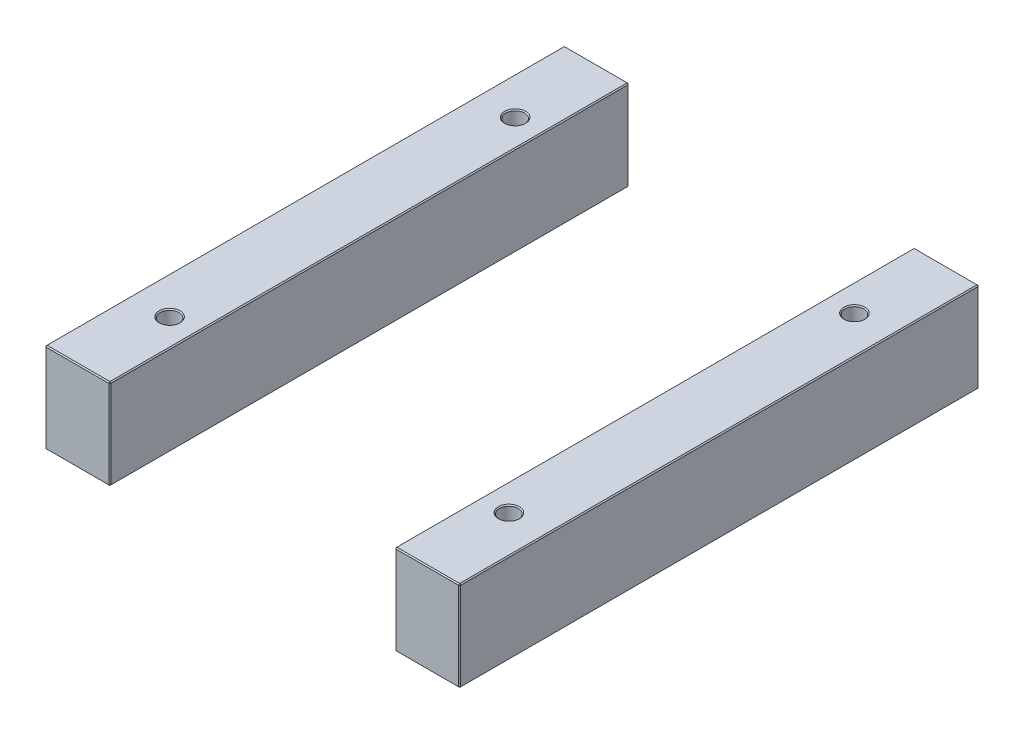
ISO-10303-21;
HEADER;
FILE_DESCRIPTION(('STEP AP214'),'2;1');
FILE_NAME('part.step','',(''),(''),'','','');
FILE_SCHEMA(('AUTOMOTIVE_DESIGN { 1 0 10303 214 1 1 1 1 }'));
ENDSEC;
DATA;
#1=APPLICATION_CONTEXT('core data for automotive mechanical design processes');
#2=APPLICATION_PROTOCOL_DEFINITION('international standard','automotive_design',2000,#1);
#3=PRODUCT_CONTEXT('',#1,'mechanical');
#4=PRODUCT('Part','Part','',(#3));
#5=PRODUCT_RELATED_PRODUCT_CATEGORY('part','',(#4));
#6=PRODUCT_DEFINITION_FORMATION('','',#4);
#7=PRODUCT_DEFINITION_CONTEXT('part definition',#1,'design');
#8=PRODUCT_DEFINITION('design','',#6,#7);
#9=PRODUCT_DEFINITION_SHAPE('','',#8);
#10=(LENGTH_UNIT() NAMED_UNIT(*) SI_UNIT(.MILLI.,.METRE.));
#11=(NAMED_UNIT(*) PLANE_ANGLE_UNIT() SI_UNIT($,.RADIAN.));
#12=(NAMED_UNIT(*) SI_UNIT($,.STERADIAN.) SOLID_ANGLE_UNIT());
#13=UNCERTAINTY_MEASURE_WITH_UNIT(LENGTH_MEASURE(1.E-05),#10,'distance_accuracy_value','');
#14=(GEOMETRIC_REPRESENTATION_CONTEXT(3) GLOBAL_UNCERTAINTY_ASSIGNED_CONTEXT((#13)) GLOBAL_UNIT_ASSIGNED_CONTEXT((#10,
#11,#12)) REPRESENTATION_CONTEXT('',''));
#15=CARTESIAN_POINT('',(0.,0.,0.));
#16=DIRECTION('',(0.,0.,1.));
#17=DIRECTION('',(1.,0.,0.));
#18=AXIS2_PLACEMENT_3D('',#15,#16,#17);
#19=CARTESIAN_POINT('',(-198.,86.,-248.));
#20=DIRECTION('',(0.,0.,1.));
#21=DIRECTION('',(1.,0.,0.));
#22=AXIS2_PLACEMENT_3D('',#19,#20,#21);
#23=PLANE('',#22);
#24=DIRECTION('',(-1.,0.,0.));
#25=VECTOR('',#24,1.);
#26=CARTESIAN_POINT('',(-198.,0.999999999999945,-248.));
#27=LINE('',#26,#25);
#28=CARTESIAN_POINT('',(-137.,0.999999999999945,-248.));
#29=VERTEX_POINT('',#28);
#30=CARTESIAN_POINT('',(-197.,0.999999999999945,-248.));
#31=VERTEX_POINT('',#30);
#32=EDGE_CURVE('P0_E137',#29,#31,#27,.T.);
#33=ORIENTED_EDGE('',*,*,#32,.T.);
#34=DIRECTION('',(0.,1.,0.));
#35=VECTOR('',#34,1.);
#36=CARTESIAN_POINT('',(-197.,86.,-248.));
#37=LINE('',#36,#35);
#38=CARTESIAN_POINT('',(-197.,85.,-248.));
#39=VERTEX_POINT('',#38);
#40=EDGE_CURVE('P0_E235',#31,#39,#37,.T.);
#41=ORIENTED_EDGE('',*,*,#40,.T.);
#42=DIRECTION('',(1.,0.,0.));
#43=VECTOR('',#42,1.);
#44=CARTESIAN_POINT('',(-198.,85.,-248.));
#45=LINE('',#44,#43);
#46=CARTESIAN_POINT('',(-137.,85.,-248.));
#47=VERTEX_POINT('',#46);
#48=EDGE_CURVE('P0_E233',#39,#47,#45,.T.);
#49=ORIENTED_EDGE('',*,*,#48,.T.);
#50=DIRECTION('',(0.,-1.,0.));
#51=VECTOR('',#50,1.);
#52=CARTESIAN_POINT('',(-137.,86.,-248.));
#53=LINE('',#52,#51);
#54=EDGE_CURVE('P0_E230',#47,#29,#53,.T.);
#55=ORIENTED_EDGE('',*,*,#54,.T.);
#56=EDGE_LOOP('',(#33,#41,#49,#55));
#57=FACE_BOUND('',#56,.T.);
#58=ADVANCED_FACE('P0_F16',(#57),#23,.F.);
#59=CARTESIAN_POINT('',(-198.,86.,248.));
#60=DIRECTION('',(1.,0.,0.));
#61=DIRECTION('',(0.,0.,-1.));
#62=AXIS2_PLACEMENT_3D('',#59,#60,#61);
#63=PLANE('',#62);
#64=DIRECTION('',(0.,1.,0.));
#65=VECTOR('',#64,1.);
#66=CARTESIAN_POINT('',(-198.,86.,247.));
#67=LINE('',#66,#65);
#68=CARTESIAN_POINT('',(-198.,0.999999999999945,247.));
#69=VERTEX_POINT('',#68);
#70=CARTESIAN_POINT('',(-198.,85.,247.));
#71=VERTEX_POINT('',#70);
#72=EDGE_CURVE('P0_E217',#69,#71,#67,.T.);
#73=ORIENTED_EDGE('',*,*,#72,.T.);
#74=DIRECTION('',(0.,0.,-1.));
#75=VECTOR('',#74,1.);
#76=CARTESIAN_POINT('',(-198.,85.,248.));
#77=LINE('',#76,#75);
#78=CARTESIAN_POINT('',(-198.,85.,-247.));
#79=VERTEX_POINT('',#78);
#80=EDGE_CURVE('P0_E228',#71,#79,#77,.T.);
#81=ORIENTED_EDGE('',*,*,#80,.T.);
#82=DIRECTION('',(0.,-1.,0.));
#83=VECTOR('',#82,1.);
#84=CARTESIAN_POINT('',(-198.,86.,-247.));
#85=LINE('',#84,#83);
#86=CARTESIAN_POINT('',(-198.,0.999999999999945,-247.));
#87=VERTEX_POINT('',#86);
#88=EDGE_CURVE('P0_E225',#79,#87,#85,.T.);
#89=ORIENTED_EDGE('',*,*,#88,.T.);
#90=DIRECTION('',(0.,0.,1.));
#91=VECTOR('',#90,1.);
#92=CARTESIAN_POINT('',(-198.,0.999999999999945,248.));
#93=LINE('',#92,#91);
#94=EDGE_CURVE('P0_E214',#87,#69,#93,.T.);
#95=ORIENTED_EDGE('',*,*,#94,.T.);
#96=EDGE_LOOP('',(#73,#81,#89,#95));
#97=FACE_BOUND('',#96,.T.);
#98=ADVANCED_FACE('P0_F302',(#97),#63,.F.);
#99=CARTESIAN_POINT('',(-198.,86.,248.));
#100=DIRECTION('',(0.,0.,-1.));
#101=DIRECTION('',(-1.,0.,0.));
#102=AXIS2_PLACEMENT_3D('',#99,#100,#101);
#103=PLANE('',#102);
#104=DIRECTION('',(-1.,0.,0.));
#105=VECTOR('',#104,1.);
#106=CARTESIAN_POINT('',(-198.,85.,248.));
#107=LINE('',#106,#105);
#108=CARTESIAN_POINT('',(-137.,85.,248.));
#109=VERTEX_POINT('',#108);
#110=CARTESIAN_POINT('',(-197.,85.,248.));
#111=VERTEX_POINT('',#110);
#112=EDGE_CURVE('P0_E242',#109,#111,#107,.T.);
#113=ORIENTED_EDGE('',*,*,#112,.T.);
#114=DIRECTION('',(0.,-1.,0.));
#115=VECTOR('',#114,1.);
#116=CARTESIAN_POINT('',(-197.,86.,248.));
#117=LINE('',#116,#115);
#118=CARTESIAN_POINT('',(-197.,0.999999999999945,248.));
#119=VERTEX_POINT('',#118);
#120=EDGE_CURVE('P0_E244',#111,#119,#117,.T.);
#121=ORIENTED_EDGE('',*,*,#120,.T.);
#122=DIRECTION('',(1.,0.,0.));
#123=VECTOR('',#122,1.);
#124=CARTESIAN_POINT('',(-136.,0.999999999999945,248.));
#125=LINE('',#124,#123);
#126=CARTESIAN_POINT('',(-137.,0.999999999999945,248.));
#127=VERTEX_POINT('',#126);
#128=EDGE_CURVE('P0_E240',#119,#127,#125,.T.);
#129=ORIENTED_EDGE('',*,*,#128,.T.);
#130=DIRECTION('',(0.,1.,0.));
#131=VECTOR('',#130,1.);
#132=CARTESIAN_POINT('',(-137.,86.,248.));
#133=LINE('',#132,#131);
#134=EDGE_CURVE('P0_E238',#127,#109,#133,.T.);
#135=ORIENTED_EDGE('',*,*,#134,.T.);
#136=EDGE_LOOP('',(#113,#121,#129,#135));
#137=FACE_BOUND('',#136,.T.);
#138=ADVANCED_FACE('P0_F341',(#137),#103,.F.);
#139=CARTESIAN_POINT('',(-136.,86.,-248.));
#140=DIRECTION('',(-1.,0.,0.));
#141=DIRECTION('',(0.,0.,1.));
#142=AXIS2_PLACEMENT_3D('',#139,#140,#141);
#143=PLANE('',#142);
#144=DIRECTION('',(0.,0.,1.));
#145=VECTOR('',#144,1.);
#146=CARTESIAN_POINT('',(-136.,85.,-248.));
#147=LINE('',#146,#145);
#148=CARTESIAN_POINT('',(-136.,85.,-247.));
#149=VERTEX_POINT('',#148);
#150=CARTESIAN_POINT('',(-136.,85.,247.));
#151=VERTEX_POINT('',#150);
#152=EDGE_CURVE('P0_E31',#149,#151,#147,.T.);
#153=ORIENTED_EDGE('',*,*,#152,.T.);
#154=DIRECTION('',(0.,-1.,0.));
#155=VECTOR('',#154,1.);
#156=CARTESIAN_POINT('',(-136.,86.,247.));
#157=LINE('',#156,#155);
#158=CARTESIAN_POINT('',(-136.,0.999999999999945,247.));
#159=VERTEX_POINT('',#158);
#160=EDGE_CURVE('P0_E190',#151,#159,#157,.T.);
#161=ORIENTED_EDGE('',*,*,#160,.T.);
#162=DIRECTION('',(0.,0.,-1.));
#163=VECTOR('',#162,1.);
#164=CARTESIAN_POINT('',(-136.,0.999999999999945,-248.));
#165=LINE('',#164,#163);
#166=CARTESIAN_POINT('',(-136.,0.999999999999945,-247.));
#167=VERTEX_POINT('',#166);
#168=EDGE_CURVE('P0_E256',#159,#167,#165,.T.);
#169=ORIENTED_EDGE('',*,*,#168,.T.);
#170=DIRECTION('',(0.,1.,0.));
#171=VECTOR('',#170,1.);
#172=CARTESIAN_POINT('',(-136.,86.,-247.));
#173=LINE('',#172,#171);
#174=EDGE_CURVE('P0_E36',#167,#149,#173,.T.);
#175=ORIENTED_EDGE('',*,*,#174,.T.);
#176=EDGE_LOOP('',(#153,#161,#169,#175));
#177=FACE_BOUND('',#176,.T.);
#178=ADVANCED_FACE('P0_F535',(#177),#143,.F.);
#179=CARTESIAN_POINT('',(0.,86.,0.));
#180=DIRECTION('',(0.,-1.,0.));
#181=DIRECTION('',(0.,0.,-1.));
#182=AXIS2_PLACEMENT_3D('',#179,#180,#181);
#183=PLANE('',#182);
#184=CARTESIAN_POINT('',(-162.,86.,165.));
#185=DIRECTION('',(0.,-1.,0.));
#186=DIRECTION('',(0.,0.,-1.));
#187=AXIS2_PLACEMENT_3D('',#184,#185,#186);
#188=CIRCLE('',#187,10.);
#189=CARTESIAN_POINT('',(-162.,86.,155.));
#190=VERTEX_POINT('',#189);
#191=EDGE_CURVE('P0_E24',#190,#190,#188,.T.);
#192=ORIENTED_EDGE('',*,*,#191,.T.);
#193=EDGE_LOOP('',(#192));
#194=FACE_BOUND('',#193,.T.);
#195=CARTESIAN_POINT('',(-162.,86.,-165.));
#196=DIRECTION('',(0.,-1.,0.));
#197=DIRECTION('',(0.,0.,-1.));
#198=AXIS2_PLACEMENT_3D('',#195,#196,#197);
#199=CIRCLE('',#198,10.0000000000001);
#200=CARTESIAN_POINT('',(-162.,86.,-175.));
#201=VERTEX_POINT('',#200);
#202=EDGE_CURVE('P0_E189',#201,#201,#199,.T.);
#203=ORIENTED_EDGE('',*,*,#202,.T.);
#204=EDGE_LOOP('',(#203));
#205=FACE_BOUND('',#204,.T.);
#206=DIRECTION('',(0.,0.,1.));
#207=VECTOR('',#206,1.);
#208=CARTESIAN_POINT('',(-197.,86.,0.));
#209=LINE('',#208,#207);
#210=CARTESIAN_POINT('',(-197.,86.,-247.));
#211=VERTEX_POINT('',#210);
#212=CARTESIAN_POINT('',(-197.,86.,247.));
#213=VERTEX_POINT('',#212);
#214=EDGE_CURVE('P0_E251',#211,#213,#209,.T.);
#215=ORIENTED_EDGE('',*,*,#214,.T.);
#216=DIRECTION('',(1.,0.,0.));
#217=VECTOR('',#216,1.);
#218=CARTESIAN_POINT('',(0.,86.,247.));
#219=LINE('',#218,#217);
#220=CARTESIAN_POINT('',(-137.,86.,247.));
#221=VERTEX_POINT('',#220);
#222=EDGE_CURVE('P0_E253',#213,#221,#219,.T.);
#223=ORIENTED_EDGE('',*,*,#222,.T.);
#224=DIRECTION('',(0.,0.,-1.));
#225=VECTOR('',#224,1.);
#226=CARTESIAN_POINT('',(-137.,86.,0.));
#227=LINE('',#226,#225);
#228=CARTESIAN_POINT('',(-137.,86.,-247.));
#229=VERTEX_POINT('',#228);
#230=EDGE_CURVE('P0_E247',#221,#229,#227,.T.);
#231=ORIENTED_EDGE('',*,*,#230,.T.);
#232=DIRECTION('',(-1.,0.,0.));
#233=VECTOR('',#232,1.);
#234=CARTESIAN_POINT('',(0.,86.,-247.));
#235=LINE('',#234,#233);
#236=EDGE_CURVE('P0_E249',#229,#211,#235,.T.);
#237=ORIENTED_EDGE('',*,*,#236,.T.);
#238=EDGE_LOOP('',(#215,#223,#231,#237));
#239=FACE_BOUND('',#238,.T.);
#240=ADVANCED_FACE('P0_F195',(#194,#205,#239),#183,.F.);
#241=CARTESIAN_POINT('',(0.,0.,0.));
#242=DIRECTION('',(0.,-1.,0.));
#243=DIRECTION('',(0.,0.,-1.));
#244=AXIS2_PLACEMENT_3D('',#241,#242,#243);
#245=PLANE('',#244);
#246=CARTESIAN_POINT('',(-162.,0.,-165.));
#247=DIRECTION('',(0.,-1.,0.));
#248=DIRECTION('',(0.,0.,-1.));
#249=AXIS2_PLACEMENT_3D('',#246,#247,#248);
#250=CIRCLE('',#249,10.);
#251=CARTESIAN_POINT('',(-162.,0.,-175.));
#252=VERTEX_POINT('',#251);
#253=EDGE_CURVE('P0_E220',#252,#252,#250,.F.);
#254=ORIENTED_EDGE('',*,*,#253,.T.);
#255=EDGE_LOOP('',(#254));
#256=FACE_BOUND('',#255,.T.);
#257=CARTESIAN_POINT('',(-162.,0.,165.));
#258=DIRECTION('',(0.,-1.,0.));
#259=DIRECTION('',(0.,0.,-1.));
#260=AXIS2_PLACEMENT_3D('',#257,#258,#259);
#261=CIRCLE('',#260,10.);
#262=CARTESIAN_POINT('',(-162.,0.,155.));
#263=VERTEX_POINT('',#262);
#264=EDGE_CURVE('P0_E608',#263,#263,#261,.F.);
#265=ORIENTED_EDGE('',*,*,#264,.T.);
#266=EDGE_LOOP('',(#265));
#267=FACE_BOUND('',#266,.T.);
#268=DIRECTION('',(-1.,0.,0.));
#269=VECTOR('',#268,1.);
#270=CARTESIAN_POINT('',(-198.,0.,247.));
#271=LINE('',#270,#269);
#272=CARTESIAN_POINT('',(-137.,0.,247.));
#273=VERTEX_POINT('',#272);
#274=CARTESIAN_POINT('',(-197.,0.,247.));
#275=VERTEX_POINT('',#274);
#276=EDGE_CURVE('P0_E114',#273,#275,#271,.T.);
#277=ORIENTED_EDGE('',*,*,#276,.T.);
#278=DIRECTION('',(0.,0.,-1.));
#279=VECTOR('',#278,1.);
#280=CARTESIAN_POINT('',(-197.,0.,-248.));
#281=LINE('',#280,#279);
#282=CARTESIAN_POINT('',(-197.,0.,-247.));
#283=VERTEX_POINT('',#282);
#284=EDGE_CURVE('P0_E110',#275,#283,#281,.T.);
#285=ORIENTED_EDGE('',*,*,#284,.T.);
#286=DIRECTION('',(1.,0.,0.));
#287=VECTOR('',#286,1.);
#288=CARTESIAN_POINT('',(-136.,0.,-247.));
#289=LINE('',#288,#287);
#290=CARTESIAN_POINT('',(-137.,0.,-247.));
#291=VERTEX_POINT('',#290);
#292=EDGE_CURVE('P0_E104',#283,#291,#289,.T.);
#293=ORIENTED_EDGE('',*,*,#292,.T.);
#294=DIRECTION('',(0.,0.,1.));
#295=VECTOR('',#294,1.);
#296=CARTESIAN_POINT('',(-137.,0.,248.));
#297=LINE('',#296,#295);
#298=EDGE_CURVE('P0_E107',#291,#273,#297,.T.);
#299=ORIENTED_EDGE('',*,*,#298,.T.);
#300=EDGE_LOOP('',(#277,#285,#293,#299));
#301=FACE_BOUND('',#300,.T.);
#302=ADVANCED_FACE('P0_F106',(#256,#267,#301),#245,.T.);
#303=CARTESIAN_POINT('',(-162.,0.,-165.));
#304=DIRECTION('',(0.,1.,0.));
#305=DIRECTION('',(0.,0.,1.));
#306=AXIS2_PLACEMENT_3D('',#303,#304,#305);
#307=CYLINDRICAL_SURFACE('',#306,9.);
#308=CARTESIAN_POINT('',(-162.,85.,-165.));
#309=DIRECTION('',(0.,-1.,0.));
#310=DIRECTION('',(0.,0.,-1.));
#311=AXIS2_PLACEMENT_3D('',#308,#309,#310);
#312=CIRCLE('',#311,9.);
#313=CARTESIAN_POINT('',(-162.,85.,-174.));
#314=VERTEX_POINT('',#313);
#315=EDGE_CURVE('P0_E10',#314,#314,#312,.F.);
#316=ORIENTED_EDGE('',*,*,#315,.T.);
#317=EDGE_LOOP('',(#316));
#318=FACE_BOUND('',#317,.T.);
#319=CARTESIAN_POINT('',(-162.,0.999999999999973,-165.));
#320=DIRECTION('',(0.,-1.,0.));
#321=DIRECTION('',(0.,0.,-1.));
#322=AXIS2_PLACEMENT_3D('',#319,#320,#321);
#323=CIRCLE('',#322,9.);
#324=CARTESIAN_POINT('',(-162.,0.999999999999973,-174.));
#325=VERTEX_POINT('',#324);
#326=EDGE_CURVE('P0_E215',#325,#325,#323,.T.);
#327=ORIENTED_EDGE('',*,*,#326,.T.);
#328=EDGE_LOOP('',(#327));
#329=FACE_BOUND('',#328,.T.);
#330=ADVANCED_FACE('P0_F208',(#318,#329),#307,.F.);
#331=CARTESIAN_POINT('',(-162.,0.,165.));
#332=DIRECTION('',(0.,1.,0.));
#333=DIRECTION('',(0.,0.,1.));
#334=AXIS2_PLACEMENT_3D('',#331,#332,#333);
#335=CYLINDRICAL_SURFACE('',#334,9.);
#336=CARTESIAN_POINT('',(-162.,85.,165.));
#337=DIRECTION('',(0.,-1.,0.));
#338=DIRECTION('',(0.,0.,-1.));
#339=AXIS2_PLACEMENT_3D('',#336,#337,#338);
#340=CIRCLE('',#339,9.);
#341=CARTESIAN_POINT('',(-162.,85.,156.));
#342=VERTEX_POINT('',#341);
#343=EDGE_CURVE('P0_E186',#342,#342,#340,.F.);
#344=ORIENTED_EDGE('',*,*,#343,.T.);
#345=EDGE_LOOP('',(#344));
#346=FACE_BOUND('',#345,.T.);
#347=CARTESIAN_POINT('',(-162.,0.999999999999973,165.));
#348=DIRECTION('',(0.,-1.,0.));
#349=DIRECTION('',(0.,0.,-1.));
#350=AXIS2_PLACEMENT_3D('',#347,#348,#349);
#351=CIRCLE('',#350,9.);
#352=CARTESIAN_POINT('',(-162.,0.999999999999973,156.));
#353=VERTEX_POINT('',#352);
#354=EDGE_CURVE('P0_E212',#353,#353,#351,.T.);
#355=ORIENTED_EDGE('',*,*,#354,.T.);
#356=EDGE_LOOP('',(#355));
#357=FACE_BOUND('',#356,.T.);
#358=ADVANCED_FACE('P0_F204',(#346,#357),#335,.F.);
#359=CARTESIAN_POINT('',(-162.,0.,-165.));
#360=DIRECTION('',(0.,-1.,0.));
#361=DIRECTION('',(0.,0.,-1.));
#362=AXIS2_PLACEMENT_3D('',#359,#360,#361);
#363=CONICAL_SURFACE('',#362,10.,0.78539816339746);
#364=ORIENTED_EDGE('',*,*,#326,.F.);
#365=EDGE_LOOP('',(#364));
#366=FACE_BOUND('',#365,.T.);
#367=ORIENTED_EDGE('',*,*,#253,.F.);
#368=EDGE_LOOP('',(#367));
#369=FACE_BOUND('',#368,.T.);
#370=ADVANCED_FACE('P0_F207',(#366,#369),#363,.F.);
#371=CARTESIAN_POINT('',(-162.,0.,165.));
#372=DIRECTION('',(0.,-1.,0.));
#373=DIRECTION('',(0.,0.,-1.));
#374=AXIS2_PLACEMENT_3D('',#371,#372,#373);
#375=CONICAL_SURFACE('',#374,10.,0.78539816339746);
#376=ORIENTED_EDGE('',*,*,#354,.F.);
#377=EDGE_LOOP('',(#376));
#378=FACE_BOUND('',#377,.T.);
#379=ORIENTED_EDGE('',*,*,#264,.F.);
#380=EDGE_LOOP('',(#379));
#381=FACE_BOUND('',#380,.T.);
#382=ADVANCED_FACE('P0_F347',(#378,#381),#375,.F.);
#383=CARTESIAN_POINT('',(-136.,86.,247.));
#384=DIRECTION('',(-0.707106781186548,0.,-0.707106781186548));
#385=DIRECTION('',(0.,-1.,0.));
#386=AXIS2_PLACEMENT_3D('',#383,#384,#385);
#387=PLANE('',#386);
#388=DIRECTION('',(-0.707106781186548,0.,0.707106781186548));
#389=VECTOR('',#388,1.);
#390=CARTESIAN_POINT('',(-136.5,85.,247.5));
#391=LINE('',#390,#389);
#392=EDGE_CURVE('P0_E125',#109,#151,#391,.F.);
#393=ORIENTED_EDGE('',*,*,#392,.F.);
#394=ORIENTED_EDGE('',*,*,#134,.F.);
#395=DIRECTION('',(0.707106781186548,0.,-0.707106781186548));
#396=VECTOR('',#395,1.);
#397=CARTESIAN_POINT('',(-137.,0.999999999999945,248.));
#398=LINE('',#397,#396);
#399=EDGE_CURVE('P0_E181',#159,#127,#398,.F.);
#400=ORIENTED_EDGE('',*,*,#399,.F.);
#401=ORIENTED_EDGE('',*,*,#160,.F.);
#402=EDGE_LOOP('',(#393,#394,#400,#401));
#403=FACE_BOUND('',#402,.T.);
#404=ADVANCED_FACE('P0_F351',(#403),#387,.F.);
#405=CARTESIAN_POINT('',(-137.,86.,247.));
#406=DIRECTION('',(0.577350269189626,0.577350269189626,0.577350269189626));
#407=DIRECTION('',(0.707106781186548,0.,-0.707106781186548));
#408=AXIS2_PLACEMENT_3D('',#405,#406,#407);
#409=PLANE('',#408);
#410=DIRECTION('',(0.,0.707106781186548,-0.707106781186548));
#411=VECTOR('',#410,1.);
#412=CARTESIAN_POINT('',(-137.,86.,247.));
#413=LINE('',#412,#411);
#414=EDGE_CURVE('P0_E175',#109,#221,#413,.T.);
#415=ORIENTED_EDGE('',*,*,#414,.F.);
#416=ORIENTED_EDGE('',*,*,#392,.T.);
#417=DIRECTION('',(0.707106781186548,-0.707106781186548,0.));
#418=VECTOR('',#417,1.);
#419=CARTESIAN_POINT('',(-137.,86.,247.));
#420=LINE('',#419,#418);
#421=EDGE_CURVE('P0_E178',#221,#151,#420,.T.);
#422=ORIENTED_EDGE('',*,*,#421,.F.);
#423=EDGE_LOOP('',(#415,#416,#422));
#424=FACE_BOUND('',#423,.T.);
#425=ADVANCED_FACE('P0_F487',(#424),#409,.T.);
#426=CARTESIAN_POINT('',(-137.,0.999999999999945,248.));
#427=DIRECTION('',(0.577350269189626,-0.577350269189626,0.577350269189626));
#428=DIRECTION('',(0.707106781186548,0.,-0.707106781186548));
#429=AXIS2_PLACEMENT_3D('',#426,#427,#428);
#430=PLANE('',#429);
#431=DIRECTION('',(0.707106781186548,0.707106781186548,0.));
#432=VECTOR('',#431,1.);
#433=CARTESIAN_POINT('',(-136.5,0.499999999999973,247.));
#434=LINE('',#433,#432);
#435=EDGE_CURVE('P0_E123',#159,#273,#434,.F.);
#436=ORIENTED_EDGE('',*,*,#435,.F.);
#437=ORIENTED_EDGE('',*,*,#399,.T.);
#438=DIRECTION('',(0.,-0.707106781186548,-0.707106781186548));
#439=VECTOR('',#438,1.);
#440=CARTESIAN_POINT('',(-137.,0.999999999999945,248.));
#441=LINE('',#440,#439);
#442=EDGE_CURVE('P0_E172',#273,#127,#441,.F.);
#443=ORIENTED_EDGE('',*,*,#442,.F.);
#444=EDGE_LOOP('',(#436,#437,#443));
#445=FACE_BOUND('',#444,.T.);
#446=ADVANCED_FACE('P0_F478',(#445),#430,.T.);
#447=CARTESIAN_POINT('',(-137.,86.,0.));
#448=DIRECTION('',(-0.707106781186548,-0.707106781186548,0.));
#449=DIRECTION('',(0.,0.,-1.));
#450=AXIS2_PLACEMENT_3D('',#447,#448,#449);
#451=PLANE('',#450);
#452=ORIENTED_EDGE('',*,*,#421,.T.);
#453=ORIENTED_EDGE('',*,*,#152,.F.);
#454=DIRECTION('',(-0.707106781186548,0.707106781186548,0.));
#455=VECTOR('',#454,1.);
#456=CARTESIAN_POINT('',(-136.5,85.5,-247.));
#457=LINE('',#456,#455);
#458=EDGE_CURVE('P0_E165',#229,#149,#457,.F.);
#459=ORIENTED_EDGE('',*,*,#458,.F.);
#460=ORIENTED_EDGE('',*,*,#230,.F.);
#461=EDGE_LOOP('',(#452,#453,#459,#460));
#462=FACE_BOUND('',#461,.T.);
#463=ADVANCED_FACE('P0_F318',(#462),#451,.F.);
#464=CARTESIAN_POINT('',(0.,86.,247.));
#465=DIRECTION('',(0.,-0.707106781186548,-0.707106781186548));
#466=DIRECTION('',(1.,0.,0.));
#467=AXIS2_PLACEMENT_3D('',#464,#465,#466);
#468=PLANE('',#467);
#469=ORIENTED_EDGE('',*,*,#414,.T.);
#470=ORIENTED_EDGE('',*,*,#222,.F.);
#471=DIRECTION('',(0.,-0.707106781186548,0.707106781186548));
#472=VECTOR('',#471,1.);
#473=CARTESIAN_POINT('',(-197.,85.5,247.5));
#474=LINE('',#473,#472);
#475=EDGE_CURVE('P0_E162',#111,#213,#474,.F.);
#476=ORIENTED_EDGE('',*,*,#475,.F.);
#477=ORIENTED_EDGE('',*,*,#112,.F.);
#478=EDGE_LOOP('',(#469,#470,#476,#477));
#479=FACE_BOUND('',#478,.T.);
#480=ADVANCED_FACE('P0_F313',(#479),#468,.F.);
#481=CARTESIAN_POINT('',(-197.,86.,248.));
#482=DIRECTION('',(0.707106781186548,0.,-0.707106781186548));
#483=DIRECTION('',(0.,-1.,0.));
#484=AXIS2_PLACEMENT_3D('',#481,#482,#483);
#485=PLANE('',#484);
#486=DIRECTION('',(0.707106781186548,0.,0.707106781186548));
#487=VECTOR('',#486,1.);
#488=CARTESIAN_POINT('',(-197.,0.999999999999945,248.));
#489=LINE('',#488,#487);
#490=EDGE_CURVE('P0_E156',#119,#69,#489,.F.);
#491=ORIENTED_EDGE('',*,*,#490,.F.);
#492=ORIENTED_EDGE('',*,*,#120,.F.);
#493=DIRECTION('',(-0.707106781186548,0.,-0.707106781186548));
#494=VECTOR('',#493,1.);
#495=CARTESIAN_POINT('',(-198.,85.,247.));
#496=LINE('',#495,#494);
#497=EDGE_CURVE('P0_E159',#71,#111,#496,.F.);
#498=ORIENTED_EDGE('',*,*,#497,.F.);
#499=ORIENTED_EDGE('',*,*,#72,.F.);
#500=EDGE_LOOP('',(#491,#492,#498,#499));
#501=FACE_BOUND('',#500,.T.);
#502=ADVANCED_FACE('P0_F307',(#501),#485,.F.);
#503=CARTESIAN_POINT('',(-198.,0.999999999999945,248.));
#504=DIRECTION('',(0.,-0.707106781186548,0.707106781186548));
#505=DIRECTION('',(-1.,0.,0.));
#506=AXIS2_PLACEMENT_3D('',#503,#504,#505);
#507=PLANE('',#506);
#508=ORIENTED_EDGE('',*,*,#442,.T.);
#509=ORIENTED_EDGE('',*,*,#128,.F.);
#510=DIRECTION('',(0.,0.707106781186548,0.707106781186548));
#511=VECTOR('',#510,1.);
#512=CARTESIAN_POINT('',(-197.,0.999999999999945,248.));
#513=LINE('',#512,#511);
#514=EDGE_CURVE('P0_E134',#275,#119,#513,.T.);
#515=ORIENTED_EDGE('',*,*,#514,.F.);
#516=ORIENTED_EDGE('',*,*,#276,.F.);
#517=EDGE_LOOP('',(#508,#509,#515,#516));
#518=FACE_BOUND('',#517,.T.);
#519=ADVANCED_FACE('P0_F333',(#518),#507,.T.);
#520=CARTESIAN_POINT('',(-136.,0.999999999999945,-248.));
#521=DIRECTION('',(0.707106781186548,-0.707106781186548,0.));
#522=DIRECTION('',(0.,0.,1.));
#523=AXIS2_PLACEMENT_3D('',#520,#521,#522);
#524=PLANE('',#523);
#525=ORIENTED_EDGE('',*,*,#435,.T.);
#526=ORIENTED_EDGE('',*,*,#298,.F.);
#527=DIRECTION('',(-0.707106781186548,-0.707106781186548,0.));
#528=VECTOR('',#527,1.);
#529=CARTESIAN_POINT('',(-137.,0.,-247.));
#530=LINE('',#529,#528);
#531=EDGE_CURVE('P0_E120',#167,#291,#530,.T.);
#532=ORIENTED_EDGE('',*,*,#531,.F.);
#533=ORIENTED_EDGE('',*,*,#168,.F.);
#534=EDGE_LOOP('',(#525,#526,#532,#533));
#535=FACE_BOUND('',#534,.T.);
#536=ADVANCED_FACE('P0_F119',(#535),#524,.T.);
#537=CARTESIAN_POINT('',(-137.,86.,-248.));
#538=DIRECTION('',(-0.707106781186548,0.,0.707106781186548));
#539=DIRECTION('',(0.,-1.,0.));
#540=AXIS2_PLACEMENT_3D('',#537,#538,#539);
#541=PLANE('',#540);
#542=DIRECTION('',(0.707106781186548,0.,0.707106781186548));
#543=VECTOR('',#542,1.);
#544=CARTESIAN_POINT('',(-137.,85.,-248.));
#545=LINE('',#544,#543);
#546=EDGE_CURVE('P0_E168',#149,#47,#545,.F.);
#547=ORIENTED_EDGE('',*,*,#546,.F.);
#548=ORIENTED_EDGE('',*,*,#174,.F.);
#549=DIRECTION('',(-0.707106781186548,0.,-0.707106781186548));
#550=VECTOR('',#549,1.);
#551=CARTESIAN_POINT('',(-136.5,0.999999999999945,-247.5));
#552=LINE('',#551,#550);
#553=EDGE_CURVE('P0_E133',#29,#167,#552,.F.);
#554=ORIENTED_EDGE('',*,*,#553,.F.);
#555=ORIENTED_EDGE('',*,*,#54,.F.);
#556=EDGE_LOOP('',(#547,#548,#554,#555));
#557=FACE_BOUND('',#556,.T.);
#558=ADVANCED_FACE('P0_F323',(#557),#541,.F.);
#559=CARTESIAN_POINT('',(-137.,85.,-248.));
#560=DIRECTION('',(0.577350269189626,0.577350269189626,-0.577350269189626));
#561=DIRECTION('',(-0.707106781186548,0.,-0.707106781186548));
#562=AXIS2_PLACEMENT_3D('',#559,#560,#561);
#563=PLANE('',#562);
#564=ORIENTED_EDGE('',*,*,#458,.T.);
#565=ORIENTED_EDGE('',*,*,#546,.T.);
#566=DIRECTION('',(0.,-0.707106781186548,-0.707106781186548));
#567=VECTOR('',#566,1.);
#568=CARTESIAN_POINT('',(-137.,85.,-248.));
#569=LINE('',#568,#567);
#570=EDGE_CURVE('P0_E151',#229,#47,#569,.T.);
#571=ORIENTED_EDGE('',*,*,#570,.F.);
#572=EDGE_LOOP('',(#564,#565,#571));
#573=FACE_BOUND('',#572,.T.);
#574=ADVANCED_FACE('P0_F321',(#573),#563,.T.);
#575=CARTESIAN_POINT('',(-198.,85.,247.));
#576=DIRECTION('',(-0.577350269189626,0.577350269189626,0.577350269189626));
#577=DIRECTION('',(0.707106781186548,0.,0.707106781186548));
#578=AXIS2_PLACEMENT_3D('',#575,#576,#577);
#579=PLANE('',#578);
#580=ORIENTED_EDGE('',*,*,#497,.T.);
#581=ORIENTED_EDGE('',*,*,#475,.T.);
#582=DIRECTION('',(0.707106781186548,0.707106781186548,0.));
#583=VECTOR('',#582,1.);
#584=CARTESIAN_POINT('',(-198.,85.,247.));
#585=LINE('',#584,#583);
#586=EDGE_CURVE('P0_E142',#71,#213,#585,.T.);
#587=ORIENTED_EDGE('',*,*,#586,.F.);
#588=EDGE_LOOP('',(#580,#581,#587));
#589=FACE_BOUND('',#588,.T.);
#590=ADVANCED_FACE('P0_F310',(#589),#579,.T.);
#591=CARTESIAN_POINT('',(-197.,0.999999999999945,248.));
#592=DIRECTION('',(-0.577350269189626,-0.577350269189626,0.577350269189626));
#593=DIRECTION('',(0.707106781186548,0.,0.707106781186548));
#594=AXIS2_PLACEMENT_3D('',#591,#592,#593);
#595=PLANE('',#594);
#596=ORIENTED_EDGE('',*,*,#514,.T.);
#597=ORIENTED_EDGE('',*,*,#490,.T.);
#598=DIRECTION('',(0.707106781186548,-0.707106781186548,0.));
#599=VECTOR('',#598,1.);
#600=CARTESIAN_POINT('',(-197.5,0.499999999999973,247.));
#601=LINE('',#600,#599);
#602=EDGE_CURVE('P0_E138',#275,#69,#601,.F.);
#603=ORIENTED_EDGE('',*,*,#602,.F.);
#604=EDGE_LOOP('',(#596,#597,#603));
#605=FACE_BOUND('',#604,.T.);
#606=ADVANCED_FACE('P0_F368',(#605),#595,.T.);
#607=CARTESIAN_POINT('',(-137.,0.,-247.));
#608=DIRECTION('',(0.577350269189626,-0.577350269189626,-0.577350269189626));
#609=DIRECTION('',(-0.707106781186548,0.,-0.707106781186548));
#610=AXIS2_PLACEMENT_3D('',#607,#608,#609);
#611=PLANE('',#610);
#612=ORIENTED_EDGE('',*,*,#553,.T.);
#613=ORIENTED_EDGE('',*,*,#531,.T.);
#614=DIRECTION('',(0.,0.707106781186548,-0.707106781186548));
#615=VECTOR('',#614,1.);
#616=CARTESIAN_POINT('',(-137.,0.,-247.));
#617=LINE('',#616,#615);
#618=EDGE_CURVE('P0_E130',#29,#291,#617,.F.);
#619=ORIENTED_EDGE('',*,*,#618,.F.);
#620=EDGE_LOOP('',(#612,#613,#619));
#621=FACE_BOUND('',#620,.T.);
#622=ADVANCED_FACE('P0_F129',(#621),#611,.T.);
#623=CARTESIAN_POINT('',(0.,86.,-247.));
#624=DIRECTION('',(0.,-0.707106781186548,0.707106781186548));
#625=DIRECTION('',(-1.,0.,0.));
#626=AXIS2_PLACEMENT_3D('',#623,#624,#625);
#627=PLANE('',#626);
#628=ORIENTED_EDGE('',*,*,#570,.T.);
#629=ORIENTED_EDGE('',*,*,#48,.F.);
#630=DIRECTION('',(0.,0.707106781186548,0.707106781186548));
#631=VECTOR('',#630,1.);
#632=CARTESIAN_POINT('',(-197.,85.,-248.));
#633=LINE('',#632,#631);
#634=EDGE_CURVE('P0_E139',#211,#39,#633,.F.);
#635=ORIENTED_EDGE('',*,*,#634,.F.);
#636=ORIENTED_EDGE('',*,*,#236,.F.);
#637=EDGE_LOOP('',(#628,#629,#635,#636));
#638=FACE_BOUND('',#637,.T.);
#639=ADVANCED_FACE('P0_F286',(#638),#627,.F.);
#640=CARTESIAN_POINT('',(-197.,86.,0.));
#641=DIRECTION('',(0.707106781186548,-0.707106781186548,0.));
#642=DIRECTION('',(0.,0.,1.));
#643=AXIS2_PLACEMENT_3D('',#640,#641,#642);
#644=PLANE('',#643);
#645=ORIENTED_EDGE('',*,*,#586,.T.);
#646=ORIENTED_EDGE('',*,*,#214,.F.);
#647=DIRECTION('',(-0.707106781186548,-0.707106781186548,0.));
#648=VECTOR('',#647,1.);
#649=CARTESIAN_POINT('',(-197.5,85.5,-247.));
#650=LINE('',#649,#648);
#651=EDGE_CURVE('P0_E145',#79,#211,#650,.F.);
#652=ORIENTED_EDGE('',*,*,#651,.F.);
#653=ORIENTED_EDGE('',*,*,#80,.F.);
#654=EDGE_LOOP('',(#645,#646,#652,#653));
#655=FACE_BOUND('',#654,.T.);
#656=ADVANCED_FACE('P0_F280',(#655),#644,.F.);
#657=CARTESIAN_POINT('',(-198.,0.999999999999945,248.));
#658=DIRECTION('',(-0.707106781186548,-0.707106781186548,0.));
#659=DIRECTION('',(0.,0.,-1.));
#660=AXIS2_PLACEMENT_3D('',#657,#658,#659);
#661=PLANE('',#660);
#662=ORIENTED_EDGE('',*,*,#602,.T.);
#663=ORIENTED_EDGE('',*,*,#94,.F.);
#664=DIRECTION('',(-0.707106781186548,0.707106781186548,0.));
#665=VECTOR('',#664,1.);
#666=CARTESIAN_POINT('',(-198.,0.999999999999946,-247.));
#667=LINE('',#666,#665);
#668=EDGE_CURVE('P0_E267',#283,#87,#667,.T.);
#669=ORIENTED_EDGE('',*,*,#668,.F.);
#670=ORIENTED_EDGE('',*,*,#284,.F.);
#671=EDGE_LOOP('',(#662,#663,#669,#670));
#672=FACE_BOUND('',#671,.T.);
#673=ADVANCED_FACE('P0_F298',(#672),#661,.T.);
#674=CARTESIAN_POINT('',(-198.,0.999999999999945,-248.));
#675=DIRECTION('',(0.,-0.707106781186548,-0.707106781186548));
#676=DIRECTION('',(1.,0.,0.));
#677=AXIS2_PLACEMENT_3D('',#674,#675,#676);
#678=PLANE('',#677);
#679=ORIENTED_EDGE('',*,*,#618,.T.);
#680=ORIENTED_EDGE('',*,*,#292,.F.);
#681=DIRECTION('',(0.,-0.707106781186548,0.707106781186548));
#682=VECTOR('',#681,1.);
#683=CARTESIAN_POINT('',(-197.,0.499999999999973,-247.5));
#684=LINE('',#683,#682);
#685=EDGE_CURVE('P0_E265',#31,#283,#684,.T.);
#686=ORIENTED_EDGE('',*,*,#685,.F.);
#687=ORIENTED_EDGE('',*,*,#32,.F.);
#688=EDGE_LOOP('',(#679,#680,#686,#687));
#689=FACE_BOUND('',#688,.T.);
#690=ADVANCED_FACE('P0_F136',(#689),#678,.T.);
#691=CARTESIAN_POINT('',(-197.,85.,-248.));
#692=DIRECTION('',(-0.577350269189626,0.577350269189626,-0.577350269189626));
#693=DIRECTION('',(-0.707106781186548,0.,0.707106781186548));
#694=AXIS2_PLACEMENT_3D('',#691,#692,#693);
#695=PLANE('',#694);
#696=ORIENTED_EDGE('',*,*,#651,.T.);
#697=ORIENTED_EDGE('',*,*,#634,.T.);
#698=DIRECTION('',(0.707106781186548,0.,-0.707106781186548));
#699=VECTOR('',#698,1.);
#700=CARTESIAN_POINT('',(-197.,85.,-248.));
#701=LINE('',#700,#699);
#702=EDGE_CURVE('P0_E263',#79,#39,#701,.T.);
#703=ORIENTED_EDGE('',*,*,#702,.F.);
#704=EDGE_LOOP('',(#696,#697,#703));
#705=FACE_BOUND('',#704,.T.);
#706=ADVANCED_FACE('P0_F273',(#705),#695,.T.);
#707=CARTESIAN_POINT('',(-198.,0.999999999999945,-247.));
#708=DIRECTION('',(-0.577350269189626,-0.577350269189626,-0.577350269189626));
#709=DIRECTION('',(-0.707106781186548,0.,0.707106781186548));
#710=AXIS2_PLACEMENT_3D('',#707,#708,#709);
#711=PLANE('',#710);
#712=ORIENTED_EDGE('',*,*,#685,.T.);
#713=ORIENTED_EDGE('',*,*,#668,.T.);
#714=DIRECTION('',(-0.707106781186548,0.,0.707106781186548));
#715=VECTOR('',#714,1.);
#716=CARTESIAN_POINT('',(-198.,0.999999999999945,-247.));
#717=LINE('',#716,#715);
#718=EDGE_CURVE('P0_E261',#31,#87,#717,.T.);
#719=ORIENTED_EDGE('',*,*,#718,.F.);
#720=EDGE_LOOP('',(#712,#713,#719));
#721=FACE_BOUND('',#720,.T.);
#722=ADVANCED_FACE('P0_F294',(#721),#711,.T.);
#723=CARTESIAN_POINT('',(-198.,86.,-247.));
#724=DIRECTION('',(0.707106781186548,0.,0.707106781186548));
#725=DIRECTION('',(0.,-1.,0.));
#726=AXIS2_PLACEMENT_3D('',#723,#724,#725);
#727=PLANE('',#726);
#728=ORIENTED_EDGE('',*,*,#702,.T.);
#729=ORIENTED_EDGE('',*,*,#40,.F.);
#730=ORIENTED_EDGE('',*,*,#718,.T.);
#731=ORIENTED_EDGE('',*,*,#88,.F.);
#732=EDGE_LOOP('',(#728,#729,#730,#731));
#733=FACE_BOUND('',#732,.T.);
#734=ADVANCED_FACE('P0_F201',(#733),#727,.F.);
#735=CARTESIAN_POINT('',(-162.,85.,165.));
#736=DIRECTION('',(0.,1.,0.));
#737=DIRECTION('',(0.,0.,1.));
#738=AXIS2_PLACEMENT_3D('',#735,#736,#737);
#739=CONICAL_SURFACE('',#738,9.,0.785398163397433);
#740=ORIENTED_EDGE('',*,*,#191,.F.);
#741=EDGE_LOOP('',(#740));
#742=FACE_BOUND('',#741,.T.);
#743=ORIENTED_EDGE('',*,*,#343,.F.);
#744=EDGE_LOOP('',(#743));
#745=FACE_BOUND('',#744,.T.);
#746=ADVANCED_FACE('P0_F198',(#742,#745),#739,.F.);
#747=CARTESIAN_POINT('',(-162.,85.,-165.));
#748=DIRECTION('',(0.,1.,0.));
#749=DIRECTION('',(0.,0.,1.));
#750=AXIS2_PLACEMENT_3D('',#747,#748,#749);
#751=CONICAL_SURFACE('',#750,9.,0.785398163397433);
#752=ORIENTED_EDGE('',*,*,#202,.F.);
#753=EDGE_LOOP('',(#752));
#754=FACE_BOUND('',#753,.T.);
#755=ORIENTED_EDGE('',*,*,#315,.F.);
#756=EDGE_LOOP('',(#755));
#757=FACE_BOUND('',#756,.T.);
#758=ADVANCED_FACE('P0_F18',(#754,#757),#751,.F.);
#759=CLOSED_SHELL('',(#58,#98,#138,#178,#240,#302,#330,#358,#370,#382,#404,#425,#446,#463,#480,
#502,#519,#536,#558,#574,#590,#606,#622,#639,#656,#673,#690,#706,#722,#734,#746,#758));
#760=MANIFOLD_SOLID_BREP('P0_B1',#759);
#761=CARTESIAN_POINT('',(198.,86.,248.));
#762=DIRECTION('',(0.,0.,-1.));
#763=DIRECTION('',(-1.,0.,0.));
#764=AXIS2_PLACEMENT_3D('',#761,#762,#763);
#765=PLANE('',#764);
#766=DIRECTION('',(0.,-1.,0.));
#767=VECTOR('',#766,1.);
#768=CARTESIAN_POINT('',(137.,86.,248.));
#769=LINE('',#768,#767);
#770=CARTESIAN_POINT('',(137.,85.,248.));
#771=VERTEX_POINT('',#770);
#772=CARTESIAN_POINT('',(137.,1.,248.));
#773=VERTEX_POINT('',#772);
#774=EDGE_CURVE('P1_E174',#771,#773,#769,.T.);
#775=ORIENTED_EDGE('',*,*,#774,.T.);
#776=DIRECTION('',(1.,0.,0.));
#777=VECTOR('',#776,1.);
#778=CARTESIAN_POINT('',(198.,1.,248.));
#779=LINE('',#778,#777);
#780=CARTESIAN_POINT('',(197.,1.,248.));
#781=VERTEX_POINT('',#780);
#782=EDGE_CURVE('P1_E176',#773,#781,#779,.T.);
#783=ORIENTED_EDGE('',*,*,#782,.T.);
#784=DIRECTION('',(0.,1.,0.));
#785=VECTOR('',#784,1.);
#786=CARTESIAN_POINT('',(197.,86.,248.));
#787=LINE('',#786,#785);
#788=CARTESIAN_POINT('',(197.,85.,248.));
#789=VERTEX_POINT('',#788);
#790=EDGE_CURVE('P1_E172',#781,#789,#787,.T.);
#791=ORIENTED_EDGE('',*,*,#790,.T.);
#792=DIRECTION('',(-1.,0.,0.));
#793=VECTOR('',#792,1.);
#794=CARTESIAN_POINT('',(136.,85.,248.));
#795=LINE('',#794,#793);
#796=EDGE_CURVE('P1_E170',#789,#771,#795,.T.);
#797=ORIENTED_EDGE('',*,*,#796,.T.);
#798=EDGE_LOOP('',(#775,#783,#791,#797));
#799=FACE_BOUND('',#798,.T.);
#800=ADVANCED_FACE('P1_F17',(#799),#765,.F.);
#801=CARTESIAN_POINT('',(198.,86.,248.));
#802=DIRECTION('',(-1.,0.,0.));
#803=DIRECTION('',(0.,0.,1.));
#804=AXIS2_PLACEMENT_3D('',#801,#802,#803);
#805=PLANE('',#804);
#806=DIRECTION('',(0.,0.,1.));
#807=VECTOR('',#806,1.);
#808=CARTESIAN_POINT('',(198.,85.,248.));
#809=LINE('',#808,#807);
#810=CARTESIAN_POINT('',(198.,85.,-247.));
#811=VERTEX_POINT('',#810);
#812=CARTESIAN_POINT('',(198.,85.,247.));
#813=VERTEX_POINT('',#812);
#814=EDGE_CURVE('P1_E188',#811,#813,#809,.T.);
#815=ORIENTED_EDGE('',*,*,#814,.T.);
#816=DIRECTION('',(0.,-1.,0.));
#817=VECTOR('',#816,1.);
#818=CARTESIAN_POINT('',(198.,86.,247.));
#819=LINE('',#818,#817);
#820=CARTESIAN_POINT('',(198.,1.,247.));
#821=VERTEX_POINT('',#820);
#822=EDGE_CURVE('P1_E194',#813,#821,#819,.T.);
#823=ORIENTED_EDGE('',*,*,#822,.T.);
#824=DIRECTION('',(0.,0.,-1.));
#825=VECTOR('',#824,1.);
#826=CARTESIAN_POINT('',(198.,1.,248.));
#827=LINE('',#826,#825);
#828=CARTESIAN_POINT('',(198.,1.,-247.));
#829=VERTEX_POINT('',#828);
#830=EDGE_CURVE('P1_E192',#821,#829,#827,.T.);
#831=ORIENTED_EDGE('',*,*,#830,.T.);
#832=DIRECTION('',(0.,1.,0.));
#833=VECTOR('',#832,1.);
#834=CARTESIAN_POINT('',(198.,86.,-247.));
#835=LINE('',#834,#833);
#836=EDGE_CURVE('P1_E190',#829,#811,#835,.T.);
#837=ORIENTED_EDGE('',*,*,#836,.T.);
#838=EDGE_LOOP('',(#815,#823,#831,#837));
#839=FACE_BOUND('',#838,.T.);
#840=ADVANCED_FACE('P1_F276',(#839),#805,.F.);
#841=CARTESIAN_POINT('',(198.,86.,-248.));
#842=DIRECTION('',(0.,0.,1.));
#843=DIRECTION('',(1.,0.,0.));
#844=AXIS2_PLACEMENT_3D('',#841,#842,#843);
#845=PLANE('',#844);
#846=DIRECTION('',(0.,-1.,0.));
#847=VECTOR('',#846,1.);
#848=CARTESIAN_POINT('',(197.,86.,-248.));
#849=LINE('',#848,#847);
#850=CARTESIAN_POINT('',(197.,85.,-248.));
#851=VERTEX_POINT('',#850);
#852=CARTESIAN_POINT('',(197.,1.,-248.));
#853=VERTEX_POINT('',#852);
#854=EDGE_CURVE('P1_E165',#851,#853,#849,.T.);
#855=ORIENTED_EDGE('',*,*,#854,.T.);
#856=DIRECTION('',(-1.,0.,0.));
#857=VECTOR('',#856,1.);
#858=CARTESIAN_POINT('',(198.,1.,-248.));
#859=LINE('',#858,#857);
#860=CARTESIAN_POINT('',(137.,1.,-248.));
#861=VERTEX_POINT('',#860);
#862=EDGE_CURVE('P1_E113',#853,#861,#859,.T.);
#863=ORIENTED_EDGE('',*,*,#862,.T.);
#864=DIRECTION('',(0.,1.,0.));
#865=VECTOR('',#864,1.);
#866=CARTESIAN_POINT('',(137.,86.,-248.));
#867=LINE('',#866,#865);
#868=CARTESIAN_POINT('',(137.,85.,-248.));
#869=VERTEX_POINT('',#868);
#870=EDGE_CURVE('P1_E167',#861,#869,#867,.T.);
#871=ORIENTED_EDGE('',*,*,#870,.T.);
#872=DIRECTION('',(1.,0.,0.));
#873=VECTOR('',#872,1.);
#874=CARTESIAN_POINT('',(198.,85.,-248.));
#875=LINE('',#874,#873);
#876=EDGE_CURVE('P1_E163',#869,#851,#875,.T.);
#877=ORIENTED_EDGE('',*,*,#876,.T.);
#878=EDGE_LOOP('',(#855,#863,#871,#877));
#879=FACE_BOUND('',#878,.T.);
#880=ADVANCED_FACE('P1_F333',(#879),#845,.F.);
#881=CARTESIAN_POINT('',(136.,86.,-248.));
#882=DIRECTION('',(1.,0.,0.));
#883=DIRECTION('',(0.,0.,-1.));
#884=AXIS2_PLACEMENT_3D('',#881,#882,#883);
#885=PLANE('',#884);
#886=DIRECTION('',(0.,0.,-1.));
#887=VECTOR('',#886,1.);
#888=CARTESIAN_POINT('',(136.,85.,-248.));
#889=LINE('',#888,#887);
#890=CARTESIAN_POINT('',(136.,85.,247.));
#891=VERTEX_POINT('',#890);
#892=CARTESIAN_POINT('',(136.,85.,-247.));
#893=VERTEX_POINT('',#892);
#894=EDGE_CURVE('P1_E179',#891,#893,#889,.T.);
#895=ORIENTED_EDGE('',*,*,#894,.T.);
#896=DIRECTION('',(0.,-1.,0.));
#897=VECTOR('',#896,1.);
#898=CARTESIAN_POINT('',(136.,86.,-247.));
#899=LINE('',#898,#897);
#900=CARTESIAN_POINT('',(136.,1.,-247.));
#901=VERTEX_POINT('',#900);
#902=EDGE_CURVE('P1_E185',#893,#901,#899,.T.);
#903=ORIENTED_EDGE('',*,*,#902,.T.);
#904=DIRECTION('',(0.,0.,1.));
#905=VECTOR('',#904,1.);
#906=CARTESIAN_POINT('',(136.,1.,-248.));
#907=LINE('',#906,#905);
#908=CARTESIAN_POINT('',(136.,1.,247.));
#909=VERTEX_POINT('',#908);
#910=EDGE_CURVE('P1_E183',#901,#909,#907,.T.);
#911=ORIENTED_EDGE('',*,*,#910,.T.);
#912=DIRECTION('',(0.,1.,0.));
#913=VECTOR('',#912,1.);
#914=CARTESIAN_POINT('',(136.,86.,247.));
#915=LINE('',#914,#913);
#916=EDGE_CURVE('P1_E181',#909,#891,#915,.T.);
#917=ORIENTED_EDGE('',*,*,#916,.T.);
#918=EDGE_LOOP('',(#895,#903,#911,#917));
#919=FACE_BOUND('',#918,.T.);
#920=ADVANCED_FACE('P1_F544',(#919),#885,.F.);
#921=CARTESIAN_POINT('',(0.,86.,0.));
#922=DIRECTION('',(0.,1.,0.));
#923=DIRECTION('',(0.,0.,1.));
#924=AXIS2_PLACEMENT_3D('',#921,#922,#923);
#925=PLANE('',#924);
#926=DIRECTION('',(-1.,0.,0.));
#927=VECTOR('',#926,1.);
#928=CARTESIAN_POINT('',(136.,86.,-247.));
#929=LINE('',#928,#927);
#930=CARTESIAN_POINT('',(197.,86.,-247.));
#931=VERTEX_POINT('',#930);
#932=CARTESIAN_POINT('',(137.,86.,-247.));
#933=VERTEX_POINT('',#932);
#934=EDGE_CURVE('P1_E26',#931,#933,#929,.T.);
#935=ORIENTED_EDGE('',*,*,#934,.T.);
#936=DIRECTION('',(0.,0.,1.));
#937=VECTOR('',#936,1.);
#938=CARTESIAN_POINT('',(137.,86.,248.));
#939=LINE('',#938,#937);
#940=CARTESIAN_POINT('',(137.,86.,247.));
#941=VERTEX_POINT('',#940);
#942=EDGE_CURVE('P1_E11',#933,#941,#939,.T.);
#943=ORIENTED_EDGE('',*,*,#942,.T.);
#944=DIRECTION('',(1.,0.,0.));
#945=VECTOR('',#944,1.);
#946=CARTESIAN_POINT('',(198.,86.,247.));
#947=LINE('',#946,#945);
#948=CARTESIAN_POINT('',(197.,86.,247.));
#949=VERTEX_POINT('',#948);
#950=EDGE_CURVE('P1_E203',#941,#949,#947,.T.);
#951=ORIENTED_EDGE('',*,*,#950,.T.);
#952=DIRECTION('',(0.,0.,-1.));
#953=VECTOR('',#952,1.);
#954=CARTESIAN_POINT('',(197.,86.,-248.));
#955=LINE('',#954,#953);
#956=EDGE_CURVE('P1_E37',#949,#931,#955,.T.);
#957=ORIENTED_EDGE('',*,*,#956,.T.);
#958=EDGE_LOOP('',(#935,#943,#951,#957));
#959=FACE_BOUND('',#958,.T.);
#960=CARTESIAN_POINT('',(162.,86.,-165.));
#961=DIRECTION('',(0.,1.,0.));
#962=DIRECTION('',(0.,0.,1.));
#963=AXIS2_PLACEMENT_3D('',#960,#961,#962);
#964=CIRCLE('',#963,10.);
#965=CARTESIAN_POINT('',(162.,86.,-155.));
#966=VERTEX_POINT('',#965);
#967=EDGE_CURVE('P1_E200',#966,#966,#964,.F.);
#968=ORIENTED_EDGE('',*,*,#967,.T.);
#969=EDGE_LOOP('',(#968));
#970=FACE_BOUND('',#969,.T.);
#971=CARTESIAN_POINT('',(162.,86.,165.));
#972=DIRECTION('',(0.,1.,0.));
#973=DIRECTION('',(0.,0.,1.));
#974=AXIS2_PLACEMENT_3D('',#971,#972,#973);
#975=CIRCLE('',#974,10.);
#976=CARTESIAN_POINT('',(162.,86.,175.));
#977=VERTEX_POINT('',#976);
#978=EDGE_CURVE('P1_E197',#977,#977,#975,.F.);
#979=ORIENTED_EDGE('',*,*,#978,.T.);
#980=EDGE_LOOP('',(#979));
#981=FACE_BOUND('',#980,.T.);
#982=ADVANCED_FACE('P1_F299',(#959,#970,#981),#925,.T.);
#983=CARTESIAN_POINT('',(0.,0.,0.));
#984=DIRECTION('',(0.,1.,0.));
#985=DIRECTION('',(0.,0.,1.));
#986=AXIS2_PLACEMENT_3D('',#983,#984,#985);
#987=PLANE('',#986);
#988=CARTESIAN_POINT('',(162.,0.,-165.));
#989=DIRECTION('',(0.,1.,0.));
#990=DIRECTION('',(0.,0.,1.));
#991=AXIS2_PLACEMENT_3D('',#988,#989,#990);
#992=CIRCLE('',#991,10.);
#993=CARTESIAN_POINT('',(162.,0.,-155.));
#994=VERTEX_POINT('',#993);
#995=EDGE_CURVE('P1_E148',#994,#994,#992,.T.);
#996=ORIENTED_EDGE('',*,*,#995,.T.);
#997=EDGE_LOOP('',(#996));
#998=FACE_BOUND('',#997,.T.);
#999=CARTESIAN_POINT('',(162.,0.,165.));
#1000=DIRECTION('',(0.,1.,0.));
#1001=DIRECTION('',(0.,0.,1.));
#1002=AXIS2_PLACEMENT_3D('',#999,#1000,#1001);
#1003=CIRCLE('',#1002,10.);
#1004=CARTESIAN_POINT('',(162.,0.,175.));
#1005=VERTEX_POINT('',#1004);
#1006=EDGE_CURVE('P1_E142',#1005,#1005,#1003,.T.);
#1007=ORIENTED_EDGE('',*,*,#1006,.T.);
#1008=EDGE_LOOP('',(#1007));
#1009=FACE_BOUND('',#1008,.T.);
#1010=DIRECTION('',(-1.,0.,0.));
#1011=VECTOR('',#1010,1.);
#1012=CARTESIAN_POINT('',(1.10574631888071E-13,0.,247.));
#1013=LINE('',#1012,#1011);
#1014=CARTESIAN_POINT('',(197.,0.,247.));
#1015=VERTEX_POINT('',#1014);
#1016=CARTESIAN_POINT('',(137.,0.,247.));
#1017=VERTEX_POINT('',#1016);
#1018=EDGE_CURVE('P1_E135',#1015,#1017,#1013,.T.);
#1019=ORIENTED_EDGE('',*,*,#1018,.T.);
#1020=DIRECTION('',(0.,0.,-1.));
#1021=VECTOR('',#1020,1.);
#1022=CARTESIAN_POINT('',(137.,0.,0.));
#1023=LINE('',#1022,#1021);
#1024=CARTESIAN_POINT('',(137.,0.,-247.));
#1025=VERTEX_POINT('',#1024);
#1026=EDGE_CURVE('P1_E139',#1017,#1025,#1023,.T.);
#1027=ORIENTED_EDGE('',*,*,#1026,.T.);
#1028=DIRECTION('',(1.,0.,0.));
#1029=VECTOR('',#1028,1.);
#1030=CARTESIAN_POINT('',(-9.95171686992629E-13,0.,-247.));
#1031=LINE('',#1030,#1029);
#1032=CARTESIAN_POINT('',(197.,0.,-247.));
#1033=VERTEX_POINT('',#1032);
#1034=EDGE_CURVE('P1_E110',#1025,#1033,#1031,.T.);
#1035=ORIENTED_EDGE('',*,*,#1034,.T.);
#1036=DIRECTION('',(0.,0.,1.));
#1037=VECTOR('',#1036,1.);
#1038=CARTESIAN_POINT('',(197.,0.,0.));
#1039=LINE('',#1038,#1037);
#1040=EDGE_CURVE('P1_E129',#1033,#1015,#1039,.T.);
#1041=ORIENTED_EDGE('',*,*,#1040,.T.);
#1042=EDGE_LOOP('',(#1019,#1027,#1035,#1041));
#1043=FACE_BOUND('',#1042,.T.);
#1044=ADVANCED_FACE('P1_F137',(#998,#1009,#1043),#987,.F.);
#1045=CARTESIAN_POINT('',(162.,0.,-165.));
#1046=DIRECTION('',(0.,1.,0.));
#1047=DIRECTION('',(0.,0.,1.));
#1048=AXIS2_PLACEMENT_3D('',#1045,#1046,#1047);
#1049=CYLINDRICAL_SURFACE('',#1048,9.);
#1050=CARTESIAN_POINT('',(162.,0.999999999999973,-165.));
#1051=DIRECTION('',(0.,1.,0.));
#1052=DIRECTION('',(0.,0.,1.));
#1053=AXIS2_PLACEMENT_3D('',#1050,#1051,#1052);
#1054=CIRCLE('',#1053,9.);
#1055=CARTESIAN_POINT('',(162.,0.999999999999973,-156.));
#1056=VERTEX_POINT('',#1055);
#1057=EDGE_CURVE('P1_E154',#1056,#1056,#1054,.F.);
#1058=ORIENTED_EDGE('',*,*,#1057,.T.);
#1059=EDGE_LOOP('',(#1058));
#1060=FACE_BOUND('',#1059,.T.);
#1061=CARTESIAN_POINT('',(162.,85.,-165.));
#1062=DIRECTION('',(0.,1.,0.));
#1063=DIRECTION('',(0.,0.,1.));
#1064=AXIS2_PLACEMENT_3D('',#1061,#1062,#1063);
#1065=CIRCLE('',#1064,9.);
#1066=CARTESIAN_POINT('',(162.,85.,-156.));
#1067=VERTEX_POINT('',#1066);
#1068=EDGE_CURVE('P1_E151',#1067,#1067,#1065,.T.);
#1069=ORIENTED_EDGE('',*,*,#1068,.T.);
#1070=EDGE_LOOP('',(#1069));
#1071=FACE_BOUND('',#1070,.T.);
#1072=ADVANCED_FACE('P1_F515',(#1060,#1071),#1049,.F.);
#1073=CARTESIAN_POINT('',(162.,0.,165.));
#1074=DIRECTION('',(0.,1.,0.));
#1075=DIRECTION('',(0.,0.,1.));
#1076=AXIS2_PLACEMENT_3D('',#1073,#1074,#1075);
#1077=CYLINDRICAL_SURFACE('',#1076,9.);
#1078=CARTESIAN_POINT('',(162.,0.999999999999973,165.));
#1079=DIRECTION('',(0.,1.,0.));
#1080=DIRECTION('',(0.,0.,1.));
#1081=AXIS2_PLACEMENT_3D('',#1078,#1079,#1080);
#1082=CIRCLE('',#1081,9.);
#1083=CARTESIAN_POINT('',(162.,0.999999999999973,174.));
#1084=VERTEX_POINT('',#1083);
#1085=EDGE_CURVE('P1_E160',#1084,#1084,#1082,.F.);
#1086=ORIENTED_EDGE('',*,*,#1085,.T.);
#1087=EDGE_LOOP('',(#1086));
#1088=FACE_BOUND('',#1087,.T.);
#1089=CARTESIAN_POINT('',(162.,85.,165.));
#1090=DIRECTION('',(0.,1.,0.));
#1091=DIRECTION('',(0.,0.,1.));
#1092=AXIS2_PLACEMENT_3D('',#1089,#1090,#1091);
#1093=CIRCLE('',#1092,9.);
#1094=CARTESIAN_POINT('',(162.,85.,174.));
#1095=VERTEX_POINT('',#1094);
#1096=EDGE_CURVE('P1_E157',#1095,#1095,#1093,.T.);
#1097=ORIENTED_EDGE('',*,*,#1096,.T.);
#1098=EDGE_LOOP('',(#1097));
#1099=FACE_BOUND('',#1098,.T.);
#1100=ADVANCED_FACE('P1_F341',(#1088,#1099),#1077,.F.);
#1101=CARTESIAN_POINT('',(162.,0.,-165.));
#1102=DIRECTION('',(0.,-1.,0.));
#1103=DIRECTION('',(0.,0.,-1.));
#1104=AXIS2_PLACEMENT_3D('',#1101,#1102,#1103);
#1105=CONICAL_SURFACE('',#1104,10.,0.785398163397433);
#1106=ORIENTED_EDGE('',*,*,#1057,.F.);
#1107=EDGE_LOOP('',(#1106));
#1108=FACE_BOUND('',#1107,.T.);
#1109=ORIENTED_EDGE('',*,*,#995,.F.);
#1110=EDGE_LOOP('',(#1109));
#1111=FACE_BOUND('',#1110,.T.);
#1112=ADVANCED_FACE('P1_F337',(#1108,#1111),#1105,.F.);
#1113=CARTESIAN_POINT('',(162.,0.,165.));
#1114=DIRECTION('',(0.,-1.,0.));
#1115=DIRECTION('',(0.,0.,-1.));
#1116=AXIS2_PLACEMENT_3D('',#1113,#1114,#1115);
#1117=CONICAL_SURFACE('',#1116,10.,0.785398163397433);
#1118=ORIENTED_EDGE('',*,*,#1085,.F.);
#1119=EDGE_LOOP('',(#1118));
#1120=FACE_BOUND('',#1119,.T.);
#1121=ORIENTED_EDGE('',*,*,#1006,.F.);
#1122=EDGE_LOOP('',(#1121));
#1123=FACE_BOUND('',#1122,.T.);
#1124=ADVANCED_FACE('P1_F340',(#1120,#1123),#1117,.F.);
#1125=CARTESIAN_POINT('',(1.10574631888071E-13,86.,247.));
#1126=DIRECTION('',(0.,0.70710678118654,0.707106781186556));
#1127=DIRECTION('',(-1.,0.,0.));
#1128=AXIS2_PLACEMENT_3D('',#1125,#1126,#1127);
#1129=PLANE('',#1128);
#1130=DIRECTION('',(0.,-0.707106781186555,0.70710678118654));
#1131=VECTOR('',#1130,1.);
#1132=CARTESIAN_POINT('',(197.,85.,248.));
#1133=LINE('',#1132,#1131);
#1134=EDGE_CURVE('P1_E21',#949,#789,#1133,.T.);
#1135=ORIENTED_EDGE('',*,*,#1134,.F.);
#1136=ORIENTED_EDGE('',*,*,#950,.F.);
#1137=DIRECTION('',(0.,0.707106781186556,-0.70710678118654));
#1138=VECTOR('',#1137,1.);
#1139=CARTESIAN_POINT('',(137.,85.5,247.5));
#1140=LINE('',#1139,#1138);
#1141=EDGE_CURVE('P1_E255',#771,#941,#1140,.T.);
#1142=ORIENTED_EDGE('',*,*,#1141,.F.);
#1143=ORIENTED_EDGE('',*,*,#796,.F.);
#1144=EDGE_LOOP('',(#1135,#1136,#1142,#1143));
#1145=FACE_BOUND('',#1144,.T.);
#1146=ADVANCED_FACE('P1_F301',(#1145),#1129,.T.);
#1147=CARTESIAN_POINT('',(197.,85.,248.));
#1148=DIRECTION('',(0.577350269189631,0.577350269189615,0.577350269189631));
#1149=DIRECTION('',(0.707106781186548,0.,-0.707106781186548));
#1150=AXIS2_PLACEMENT_3D('',#1147,#1148,#1149);
#1151=PLANE('',#1150);
#1152=DIRECTION('',(-0.707106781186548,0.707106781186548,0.));
#1153=VECTOR('',#1152,1.);
#1154=CARTESIAN_POINT('',(197.5,85.5,247.));
#1155=LINE('',#1154,#1153);
#1156=EDGE_CURVE('P1_E250',#949,#813,#1155,.F.);
#1157=ORIENTED_EDGE('',*,*,#1156,.F.);
#1158=ORIENTED_EDGE('',*,*,#1134,.T.);
#1159=DIRECTION('',(-0.707106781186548,0.,0.707106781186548));
#1160=VECTOR('',#1159,1.);
#1161=CARTESIAN_POINT('',(197.,85.,248.));
#1162=LINE('',#1161,#1160);
#1163=EDGE_CURVE('P1_E253',#813,#789,#1162,.T.);
#1164=ORIENTED_EDGE('',*,*,#1163,.F.);
#1165=EDGE_LOOP('',(#1157,#1158,#1164));
#1166=FACE_BOUND('',#1165,.T.);
#1167=ADVANCED_FACE('P1_F267',(#1166),#1151,.T.);
#1168=CARTESIAN_POINT('',(136.,85.,247.));
#1169=DIRECTION('',(-0.57735026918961,0.577350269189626,0.577350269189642));
#1170=DIRECTION('',(0.,-0.707106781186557,0.707106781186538));
#1171=AXIS2_PLACEMENT_3D('',#1168,#1169,#1170);
#1172=PLANE('',#1171);
#1173=DIRECTION('',(-0.707106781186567,0.,-0.707106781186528));
#1174=VECTOR('',#1173,1.);
#1175=CARTESIAN_POINT('',(136.,85.,247.));
#1176=LINE('',#1175,#1174);
#1177=EDGE_CURVE('P1_E245',#771,#891,#1176,.T.);
#1178=ORIENTED_EDGE('',*,*,#1177,.F.);
#1179=ORIENTED_EDGE('',*,*,#1141,.T.);
#1180=DIRECTION('',(-0.707106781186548,-0.707106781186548,0.));
#1181=VECTOR('',#1180,1.);
#1182=CARTESIAN_POINT('',(136.,85.,247.));
#1183=LINE('',#1182,#1181);
#1184=EDGE_CURVE('P1_E248',#891,#941,#1183,.F.);
#1185=ORIENTED_EDGE('',*,*,#1184,.F.);
#1186=EDGE_LOOP('',(#1178,#1179,#1185));
#1187=FACE_BOUND('',#1186,.T.);
#1188=ADVANCED_FACE('P1_F303',(#1187),#1172,.T.);
#1189=CARTESIAN_POINT('',(198.,86.,247.));
#1190=DIRECTION('',(-0.707106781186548,0.,-0.707106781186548));
#1191=DIRECTION('',(0.,-1.,0.));
#1192=AXIS2_PLACEMENT_3D('',#1189,#1190,#1191);
#1193=PLANE('',#1192);
#1194=ORIENTED_EDGE('',*,*,#1163,.T.);
#1195=ORIENTED_EDGE('',*,*,#790,.F.);
#1196=DIRECTION('',(0.707106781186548,0.,-0.707106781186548));
#1197=VECTOR('',#1196,1.);
#1198=CARTESIAN_POINT('',(197.,1.,248.));
#1199=LINE('',#1198,#1197);
#1200=EDGE_CURVE('P1_E240',#821,#781,#1199,.F.);
#1201=ORIENTED_EDGE('',*,*,#1200,.F.);
#1202=ORIENTED_EDGE('',*,*,#822,.F.);
#1203=EDGE_LOOP('',(#1194,#1195,#1201,#1202));
#1204=FACE_BOUND('',#1203,.T.);
#1205=ADVANCED_FACE('P1_F273',(#1204),#1193,.F.);
#1206=CARTESIAN_POINT('',(197.,86.,0.));
#1207=DIRECTION('',(0.707106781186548,0.707106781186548,0.));
#1208=DIRECTION('',(0.,0.,1.));
#1209=AXIS2_PLACEMENT_3D('',#1206,#1207,#1208);
#1210=PLANE('',#1209);
#1211=ORIENTED_EDGE('',*,*,#1156,.T.);
#1212=ORIENTED_EDGE('',*,*,#814,.F.);
#1213=DIRECTION('',(0.707106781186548,-0.707106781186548,0.));
#1214=VECTOR('',#1213,1.);
#1215=CARTESIAN_POINT('',(198.,85.,-247.));
#1216=LINE('',#1215,#1214);
#1217=EDGE_CURVE('P1_E237',#931,#811,#1216,.T.);
#1218=ORIENTED_EDGE('',*,*,#1217,.F.);
#1219=ORIENTED_EDGE('',*,*,#956,.F.);
#1220=EDGE_LOOP('',(#1211,#1212,#1218,#1219));
#1221=FACE_BOUND('',#1220,.T.);
#1222=ADVANCED_FACE('P1_F281',(#1221),#1210,.T.);
#1223=CARTESIAN_POINT('',(-9.95171686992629E-13,86.,-247.));
#1224=DIRECTION('',(0.,0.70710678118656,-0.707106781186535));
#1225=DIRECTION('',(1.,0.,0.));
#1226=AXIS2_PLACEMENT_3D('',#1223,#1224,#1225);
#1227=PLANE('',#1226);
#1228=DIRECTION('',(0.,-0.707106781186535,-0.70710678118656));
#1229=VECTOR('',#1228,1.);
#1230=CARTESIAN_POINT('',(137.,85.,-248.));
#1231=LINE('',#1230,#1229);
#1232=EDGE_CURVE('P1_E231',#933,#869,#1231,.T.);
#1233=ORIENTED_EDGE('',*,*,#1232,.F.);
#1234=ORIENTED_EDGE('',*,*,#934,.F.);
#1235=DIRECTION('',(0.,0.707106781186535,0.70710678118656));
#1236=VECTOR('',#1235,1.);
#1237=CARTESIAN_POINT('',(197.,85.5,-247.5));
#1238=LINE('',#1237,#1236);
#1239=EDGE_CURVE('P1_E234',#851,#931,#1238,.T.);
#1240=ORIENTED_EDGE('',*,*,#1239,.F.);
#1241=ORIENTED_EDGE('',*,*,#876,.F.);
#1242=EDGE_LOOP('',(#1233,#1234,#1240,#1241));
#1243=FACE_BOUND('',#1242,.T.);
#1244=ADVANCED_FACE('P1_F290',(#1243),#1227,.T.);
#1245=CARTESIAN_POINT('',(137.,86.,0.));
#1246=DIRECTION('',(-0.707106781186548,0.707106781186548,0.));
#1247=DIRECTION('',(0.,0.,-1.));
#1248=AXIS2_PLACEMENT_3D('',#1245,#1246,#1247);
#1249=PLANE('',#1248);
#1250=ORIENTED_EDGE('',*,*,#1184,.T.);
#1251=ORIENTED_EDGE('',*,*,#942,.F.);
#1252=DIRECTION('',(0.707106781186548,0.707106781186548,0.));
#1253=VECTOR('',#1252,1.);
#1254=CARTESIAN_POINT('',(136.5,85.5,-247.));
#1255=LINE('',#1254,#1253);
#1256=EDGE_CURVE('P1_E228',#893,#933,#1255,.T.);
#1257=ORIENTED_EDGE('',*,*,#1256,.F.);
#1258=ORIENTED_EDGE('',*,*,#894,.F.);
#1259=EDGE_LOOP('',(#1250,#1251,#1257,#1258));
#1260=FACE_BOUND('',#1259,.T.);
#1261=ADVANCED_FACE('P1_F298',(#1260),#1249,.T.);
#1262=CARTESIAN_POINT('',(137.,86.,248.));
#1263=DIRECTION('',(0.707106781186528,0.,-0.707106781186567));
#1264=DIRECTION('',(0.,-1.,0.));
#1265=AXIS2_PLACEMENT_3D('',#1262,#1263,#1264);
#1266=PLANE('',#1265);
#1267=ORIENTED_EDGE('',*,*,#1177,.T.);
#1268=ORIENTED_EDGE('',*,*,#916,.F.);
#1269=DIRECTION('',(0.707106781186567,0.,0.707106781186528));
#1270=VECTOR('',#1269,1.);
#1271=CARTESIAN_POINT('',(136.5,1.,247.5));
#1272=LINE('',#1271,#1270);
#1273=EDGE_CURVE('P1_E225',#773,#909,#1272,.F.);
#1274=ORIENTED_EDGE('',*,*,#1273,.F.);
#1275=ORIENTED_EDGE('',*,*,#774,.F.);
#1276=EDGE_LOOP('',(#1267,#1268,#1274,#1275));
#1277=FACE_BOUND('',#1276,.T.);
#1278=ADVANCED_FACE('P1_F307',(#1277),#1266,.F.);
#1279=CARTESIAN_POINT('',(198.,1.,248.));
#1280=DIRECTION('',(0.,0.70710678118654,-0.707106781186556));
#1281=DIRECTION('',(1.,0.,0.));
#1282=AXIS2_PLACEMENT_3D('',#1279,#1280,#1281);
#1283=PLANE('',#1282);
#1284=DIRECTION('',(0.,0.707106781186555,0.70710678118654));
#1285=VECTOR('',#1284,1.);
#1286=CARTESIAN_POINT('',(197.,1.,248.));
#1287=LINE('',#1286,#1285);
#1288=EDGE_CURVE('P1_E242',#781,#1015,#1287,.F.);
#1289=ORIENTED_EDGE('',*,*,#1288,.F.);
#1290=ORIENTED_EDGE('',*,*,#782,.F.);
#1291=DIRECTION('',(0.,-0.707106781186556,-0.70710678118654));
#1292=VECTOR('',#1291,1.);
#1293=CARTESIAN_POINT('',(137.,0.,247.));
#1294=LINE('',#1293,#1292);
#1295=EDGE_CURVE('P1_E222',#1017,#773,#1294,.F.);
#1296=ORIENTED_EDGE('',*,*,#1295,.F.);
#1297=ORIENTED_EDGE('',*,*,#1018,.F.);
#1298=EDGE_LOOP('',(#1289,#1290,#1296,#1297));
#1299=FACE_BOUND('',#1298,.T.);
#1300=ADVANCED_FACE('P1_F313',(#1299),#1283,.F.);
#1301=CARTESIAN_POINT('',(197.,1.,248.));
#1302=DIRECTION('',(0.577350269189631,-0.577350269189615,0.577350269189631));
#1303=DIRECTION('',(0.707106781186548,0.,-0.707106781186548));
#1304=AXIS2_PLACEMENT_3D('',#1301,#1302,#1303);
#1305=PLANE('',#1304);
#1306=ORIENTED_EDGE('',*,*,#1200,.T.);
#1307=ORIENTED_EDGE('',*,*,#1288,.T.);
#1308=DIRECTION('',(-0.707106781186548,-0.707106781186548,0.));
#1309=VECTOR('',#1308,1.);
#1310=CARTESIAN_POINT('',(197.5,0.499999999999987,247.));
#1311=LINE('',#1310,#1309);
#1312=EDGE_CURVE('P1_E132',#821,#1015,#1311,.T.);
#1313=ORIENTED_EDGE('',*,*,#1312,.F.);
#1314=EDGE_LOOP('',(#1306,#1307,#1313));
#1315=FACE_BOUND('',#1314,.T.);
#1316=ADVANCED_FACE('P1_F316',(#1315),#1305,.T.);
#1317=CARTESIAN_POINT('',(198.,85.,-247.));
#1318=DIRECTION('',(0.57735026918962,0.577350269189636,-0.57735026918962));
#1319=DIRECTION('',(0.,0.707106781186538,0.707106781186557));
#1320=AXIS2_PLACEMENT_3D('',#1317,#1318,#1319);
#1321=PLANE('',#1320);
#1322=ORIENTED_EDGE('',*,*,#1239,.T.);
#1323=ORIENTED_EDGE('',*,*,#1217,.T.);
#1324=DIRECTION('',(0.707106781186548,0.,0.707106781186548));
#1325=VECTOR('',#1324,1.);
#1326=CARTESIAN_POINT('',(198.,85.,-247.));
#1327=LINE('',#1326,#1325);
#1328=EDGE_CURVE('P1_E218',#851,#811,#1327,.T.);
#1329=ORIENTED_EDGE('',*,*,#1328,.F.);
#1330=EDGE_LOOP('',(#1322,#1323,#1329));
#1331=FACE_BOUND('',#1330,.T.);
#1332=ADVANCED_FACE('P1_F285',(#1331),#1321,.T.);
#1333=CARTESIAN_POINT('',(137.,85.,-248.));
#1334=DIRECTION('',(-0.57735026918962,0.577350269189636,-0.57735026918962));
#1335=DIRECTION('',(0.,0.707106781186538,0.707106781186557));
#1336=AXIS2_PLACEMENT_3D('',#1333,#1334,#1335);
#1337=PLANE('',#1336);
#1338=ORIENTED_EDGE('',*,*,#1256,.T.);
#1339=ORIENTED_EDGE('',*,*,#1232,.T.);
#1340=DIRECTION('',(0.707106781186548,0.,-0.707106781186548));
#1341=VECTOR('',#1340,1.);
#1342=CARTESIAN_POINT('',(137.,85.,-248.));
#1343=LINE('',#1342,#1341);
#1344=EDGE_CURVE('P1_E215',#893,#869,#1343,.T.);
#1345=ORIENTED_EDGE('',*,*,#1344,.F.);
#1346=EDGE_LOOP('',(#1338,#1339,#1345));
#1347=FACE_BOUND('',#1346,.T.);
#1348=ADVANCED_FACE('P1_F294',(#1347),#1337,.T.);
#1349=CARTESIAN_POINT('',(137.,0.,247.));
#1350=DIRECTION('',(-0.57735026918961,-0.577350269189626,0.577350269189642));
#1351=DIRECTION('',(0.,-0.707106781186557,-0.707106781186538));
#1352=AXIS2_PLACEMENT_3D('',#1349,#1350,#1351);
#1353=PLANE('',#1352);
#1354=ORIENTED_EDGE('',*,*,#1295,.T.);
#1355=ORIENTED_EDGE('',*,*,#1273,.T.);
#1356=DIRECTION('',(-0.707106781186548,0.707106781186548,0.));
#1357=VECTOR('',#1356,1.);
#1358=CARTESIAN_POINT('',(137.,0.,247.));
#1359=LINE('',#1358,#1357);
#1360=EDGE_CURVE('P1_E126',#1017,#909,#1359,.T.);
#1361=ORIENTED_EDGE('',*,*,#1360,.F.);
#1362=EDGE_LOOP('',(#1354,#1355,#1361));
#1363=FACE_BOUND('',#1362,.T.);
#1364=ADVANCED_FACE('P1_F369',(#1363),#1353,.T.);
#1365=CARTESIAN_POINT('',(198.,1.,248.));
#1366=DIRECTION('',(-0.707106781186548,0.707106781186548,0.));
#1367=DIRECTION('',(0.,0.,-1.));
#1368=AXIS2_PLACEMENT_3D('',#1365,#1366,#1367);
#1369=PLANE('',#1368);
#1370=ORIENTED_EDGE('',*,*,#1312,.T.);
#1371=ORIENTED_EDGE('',*,*,#1040,.F.);
#1372=DIRECTION('',(0.707106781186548,0.707106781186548,0.));
#1373=VECTOR('',#1372,1.);
#1374=CARTESIAN_POINT('',(197.,0.,-247.));
#1375=LINE('',#1374,#1373);
#1376=EDGE_CURVE('P1_E120',#829,#1033,#1375,.F.);
#1377=ORIENTED_EDGE('',*,*,#1376,.F.);
#1378=ORIENTED_EDGE('',*,*,#830,.F.);
#1379=EDGE_LOOP('',(#1370,#1371,#1377,#1378));
#1380=FACE_BOUND('',#1379,.T.);
#1381=ADVANCED_FACE('P1_F130',(#1380),#1369,.F.);
#1382=CARTESIAN_POINT('',(197.,86.,-248.));
#1383=DIRECTION('',(-0.707106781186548,0.,0.707106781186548));
#1384=DIRECTION('',(0.,-1.,0.));
#1385=AXIS2_PLACEMENT_3D('',#1382,#1383,#1384);
#1386=PLANE('',#1385);
#1387=ORIENTED_EDGE('',*,*,#1328,.T.);
#1388=ORIENTED_EDGE('',*,*,#836,.F.);
#1389=DIRECTION('',(-0.707106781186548,0.,-0.707106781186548));
#1390=VECTOR('',#1389,1.);
#1391=CARTESIAN_POINT('',(197.5,1.,-247.5));
#1392=LINE('',#1391,#1390);
#1393=EDGE_CURVE('P1_E124',#853,#829,#1392,.F.);
#1394=ORIENTED_EDGE('',*,*,#1393,.F.);
#1395=ORIENTED_EDGE('',*,*,#854,.F.);
#1396=EDGE_LOOP('',(#1387,#1388,#1394,#1395));
#1397=FACE_BOUND('',#1396,.T.);
#1398=ADVANCED_FACE('P1_F362',(#1397),#1386,.F.);
#1399=CARTESIAN_POINT('',(136.,86.,-247.));
#1400=DIRECTION('',(0.707106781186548,0.,0.707106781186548));
#1401=DIRECTION('',(0.,-1.,0.));
#1402=AXIS2_PLACEMENT_3D('',#1399,#1400,#1401);
#1403=PLANE('',#1402);
#1404=ORIENTED_EDGE('',*,*,#1344,.T.);
#1405=ORIENTED_EDGE('',*,*,#870,.F.);
#1406=DIRECTION('',(-0.707106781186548,0.,0.707106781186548));
#1407=VECTOR('',#1406,1.);
#1408=CARTESIAN_POINT('',(137.,1.,-248.));
#1409=LINE('',#1408,#1407);
#1410=EDGE_CURVE('P1_E209',#901,#861,#1409,.F.);
#1411=ORIENTED_EDGE('',*,*,#1410,.F.);
#1412=ORIENTED_EDGE('',*,*,#902,.F.);
#1413=EDGE_LOOP('',(#1404,#1405,#1411,#1412));
#1414=FACE_BOUND('',#1413,.T.);
#1415=ADVANCED_FACE('P1_F358',(#1414),#1403,.F.);
#1416=CARTESIAN_POINT('',(136.,1.,-248.));
#1417=DIRECTION('',(0.707106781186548,0.707106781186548,0.));
#1418=DIRECTION('',(0.,0.,1.));
#1419=AXIS2_PLACEMENT_3D('',#1416,#1417,#1418);
#1420=PLANE('',#1419);
#1421=ORIENTED_EDGE('',*,*,#1360,.T.);
#1422=ORIENTED_EDGE('',*,*,#910,.F.);
#1423=DIRECTION('',(0.707106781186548,-0.707106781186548,0.));
#1424=VECTOR('',#1423,1.);
#1425=CARTESIAN_POINT('',(136.5,0.500000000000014,-247.));
#1426=LINE('',#1425,#1424);
#1427=EDGE_CURVE('P1_E116',#1025,#901,#1426,.F.);
#1428=ORIENTED_EDGE('',*,*,#1427,.F.);
#1429=ORIENTED_EDGE('',*,*,#1026,.F.);
#1430=EDGE_LOOP('',(#1421,#1422,#1428,#1429));
#1431=FACE_BOUND('',#1430,.T.);
#1432=ADVANCED_FACE('P1_F355',(#1431),#1420,.F.);
#1433=CARTESIAN_POINT('',(197.,0.,-247.));
#1434=DIRECTION('',(0.57735026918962,-0.577350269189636,-0.57735026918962));
#1435=DIRECTION('',(0.,0.707106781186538,-0.707106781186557));
#1436=AXIS2_PLACEMENT_3D('',#1433,#1434,#1435);
#1437=PLANE('',#1436);
#1438=ORIENTED_EDGE('',*,*,#1393,.T.);
#1439=ORIENTED_EDGE('',*,*,#1376,.T.);
#1440=DIRECTION('',(0.,-0.707106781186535,0.70710678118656));
#1441=VECTOR('',#1440,1.);
#1442=CARTESIAN_POINT('',(197.,0.,-247.));
#1443=LINE('',#1442,#1441);
#1444=EDGE_CURVE('P1_E106',#853,#1033,#1443,.T.);
#1445=ORIENTED_EDGE('',*,*,#1444,.F.);
#1446=EDGE_LOOP('',(#1438,#1439,#1445));
#1447=FACE_BOUND('',#1446,.T.);
#1448=ADVANCED_FACE('P1_F122',(#1447),#1437,.T.);
#1449=CARTESIAN_POINT('',(137.,1.,-248.));
#1450=DIRECTION('',(-0.57735026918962,-0.577350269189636,-0.57735026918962));
#1451=DIRECTION('',(0.,0.707106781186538,-0.707106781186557));
#1452=AXIS2_PLACEMENT_3D('',#1449,#1450,#1451);
#1453=PLANE('',#1452);
#1454=ORIENTED_EDGE('',*,*,#1427,.T.);
#1455=ORIENTED_EDGE('',*,*,#1410,.T.);
#1456=DIRECTION('',(0.,0.707106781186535,-0.70710678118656));
#1457=VECTOR('',#1456,1.);
#1458=CARTESIAN_POINT('',(137.,1.,-248.));
#1459=LINE('',#1458,#1457);
#1460=EDGE_CURVE('P1_E117',#1025,#861,#1459,.T.);
#1461=ORIENTED_EDGE('',*,*,#1460,.F.);
#1462=EDGE_LOOP('',(#1454,#1455,#1461));
#1463=FACE_BOUND('',#1462,.T.);
#1464=ADVANCED_FACE('P1_F349',(#1463),#1453,.T.);
#1465=CARTESIAN_POINT('',(198.,1.,-248.));
#1466=DIRECTION('',(0.,0.70710678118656,0.707106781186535));
#1467=DIRECTION('',(-1.,0.,0.));
#1468=AXIS2_PLACEMENT_3D('',#1465,#1466,#1467);
#1469=PLANE('',#1468);
#1470=ORIENTED_EDGE('',*,*,#1444,.T.);
#1471=ORIENTED_EDGE('',*,*,#1034,.F.);
#1472=ORIENTED_EDGE('',*,*,#1460,.T.);
#1473=ORIENTED_EDGE('',*,*,#862,.F.);
#1474=EDGE_LOOP('',(#1470,#1471,#1472,#1473));
#1475=FACE_BOUND('',#1474,.T.);
#1476=ADVANCED_FACE('P1_F108',(#1475),#1469,.F.);
#1477=CARTESIAN_POINT('',(162.,85.,-165.));
#1478=DIRECTION('',(0.,1.,0.));
#1479=DIRECTION('',(0.,0.,1.));
#1480=AXIS2_PLACEMENT_3D('',#1477,#1478,#1479);
#1481=CONICAL_SURFACE('',#1480,9.,0.785398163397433);
#1482=ORIENTED_EDGE('',*,*,#967,.F.);
#1483=EDGE_LOOP('',(#1482));
#1484=FACE_BOUND('',#1483,.T.);
#1485=ORIENTED_EDGE('',*,*,#1068,.F.);
#1486=EDGE_LOOP('',(#1485));
#1487=FACE_BOUND('',#1486,.T.);
#1488=ADVANCED_FACE('P1_F348',(#1484,#1487),#1481,.F.);
#1489=CARTESIAN_POINT('',(162.,85.,165.));
#1490=DIRECTION('',(0.,1.,0.));
#1491=DIRECTION('',(0.,0.,1.));
#1492=AXIS2_PLACEMENT_3D('',#1489,#1490,#1491);
#1493=CONICAL_SURFACE('',#1492,9.,0.785398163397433);
#1494=ORIENTED_EDGE('',*,*,#978,.F.);
#1495=EDGE_LOOP('',(#1494));
#1496=FACE_BOUND('',#1495,.T.);
#1497=ORIENTED_EDGE('',*,*,#1096,.F.);
#1498=EDGE_LOOP('',(#1497));
#1499=FACE_BOUND('',#1498,.T.);
#1500=ADVANCED_FACE('P1_F19',(#1496,#1499),#1493,.F.);
#1501=CLOSED_SHELL('',(#800,#840,#880,#920,#982,#1044,#1072,#1100,#1112,#1124,#1146,#1167,#1188,
#1205,#1222,#1244,#1261,#1278,#1300,#1316,#1332,#1348,#1364,#1381,#1398,#1415,#1432,#1448,#1464,
#1476,#1488,#1500));
#1502=MANIFOLD_SOLID_BREP('P1_B1',#1501);
#1503=ADVANCED_BREP_SHAPE_REPRESENTATION('',(#18,#760,#1502),#14);
#1504=SHAPE_DEFINITION_REPRESENTATION(#9,#1503);
ENDSEC;
END-ISO-10303-21;
